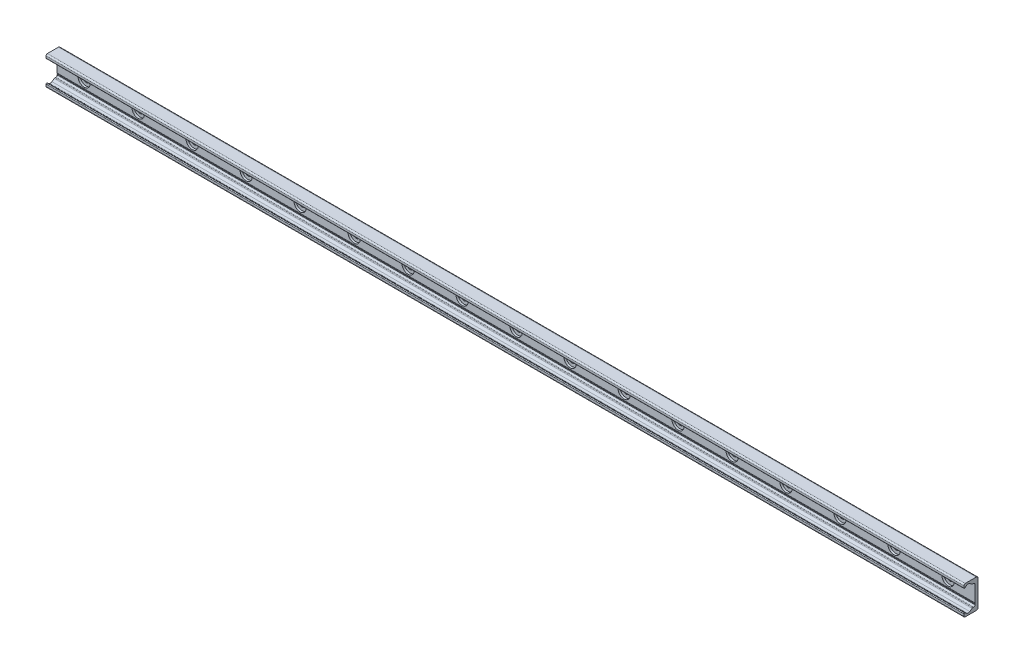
from build123d import *

# Parameters (mm, degrees)
BOSS_EXTRUDE1_DEPTH = 680
SKETCH2_R           = 9
SKETCH2_R_2         = 4.5
CUT_EXTRUDE1_DEPTH  = 3.1
SKETCH2_2_R         = 4.5
CUT_EXTRUDE2_DEPTH  = 681.539859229
LPATTERN1_COUNT     = 17
LPATTERN1_PITCH     = 80


with BuildPart() as part:
    # Sketch1 → Boss-Extrude1 (new, symmetric)
    with BuildSketch(Plane(origin=(0, 0, 0), x_dir=(0, 0, -1), z_dir=(1, 0, 0))):
        with BuildLine():
            Line((0, 0), (0, 19))
            ThreePointArc((0, 19), (-0.732233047, 20.767766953), (-2.5, 21.5))
            Line((-2.5, 21.5), (-19, 21.5))
            ThreePointArc((-19, 21.5), (-20.414213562, 20.914213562), (-21, 19.5))
            Line((-21, 19.5), (-21, 16.625057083))
            ThreePointArc((-21, 16.625057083), (-20.553251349, 15.888838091), (-19.693931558, 15.945160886))
            Line((-19.693931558, 15.945160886), (-16.794305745, 17.975500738))
            ThreePointArc((-16.794305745, 17.975500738), (-14.5, 18.69889256), (-12.205694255, 17.975500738))
            Line((-12.205694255, 17.975500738), (-8.829831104, 15.611695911))
            ThreePointArc((-8.829831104, 15.611695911), (-8.28408983, 15.342566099), (-7.682678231, 15.25))
            Line((-7.682678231, 15.25), (-6.5, 15.25))
            ThreePointArc((-6.5, 15.25), (-5.085786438, 14.664213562), (-4.5, 13.25))
            Line((-4.5, 13.25), (-4.5, -10.75))
            ThreePointArc((-4.5, -10.75), (-4.25, -11), (-4.5, -11.25))
            Line((-4.5, -11.25), (-4.5, -12.25))
            ThreePointArc((-4.5, -12.25), (-4.25, -12.5), (-4.5, -12.75))
            Line((-4.5, -12.75), (-4.5, -13.25))
            ThreePointArc((-4.5, -13.25), (-5.085786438, -14.664213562), (-6.5, -15.25))
            Line((-6.5, -15.25), (-7.682678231, -15.25))
            ThreePointArc((-7.682678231, -15.25), (-8.28408983, -15.342566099), (-8.829831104, -15.611695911))
            Line((-8.829831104, -15.611695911), (-12.205694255, -17.975500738))
            ThreePointArc((-12.205694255, -17.975500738), (-14.5, -18.69889256), (-16.794305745, -17.975500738))
            Line((-16.794305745, -17.975500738), (-19.693931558, -15.945160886))
            ThreePointArc((-19.693931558, -15.945160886), (-20.553251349, -15.888838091), (-21, -16.625057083))
            Line((-21, -16.625057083), (-21, -19.5))
            ThreePointArc((-21, -19.5), (-20.414213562, -20.914213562), (-19, -21.5))
            Line((-19, -21.5), (-2.5, -21.5))
            ThreePointArc((-2.5, -21.5), (-0.732233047, -20.767766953), (0, -19))
            Line((0, -19), (0, 0))
        make_face()
    extrude(amount=BOSS_EXTRUDE1_DEPTH, both=True)

    # Sketch2 → Cut-Extrude1 (cut)
    with BuildSketch(Plane.XY.offset(4.5)):
        with Locations((640, 0)):
            Circle(SKETCH2_R)
        with Locations((640, 0)):
            Circle(SKETCH2_R_2, mode=Mode.SUBTRACT)
    cut_extrude1 = extrude(amount=-CUT_EXTRUDE1_DEPTH, mode=Mode.SUBTRACT)

    # Sketch2_2 → Cut-Extrude2 (cut, through all)
    with BuildSketch(Plane.XY.offset(4.5)):
        with Locations((640, 0)):
            Circle(SKETCH2_2_R)
    cut_extrude2 = extrude(amount=-CUT_EXTRUDE2_DEPTH, mode=Mode.SUBTRACT)

    # LPattern1: Cut-Extrude1, Cut-Extrude2 ×17
    with Locations(*[(-i * LPATTERN1_PITCH, 0, 0) for i in range(1, LPATTERN1_COUNT)]):
        add(cut_extrude1, mode=Mode.SUBTRACT)
        add(cut_extrude2, mode=Mode.SUBTRACT)


solid = part.part
